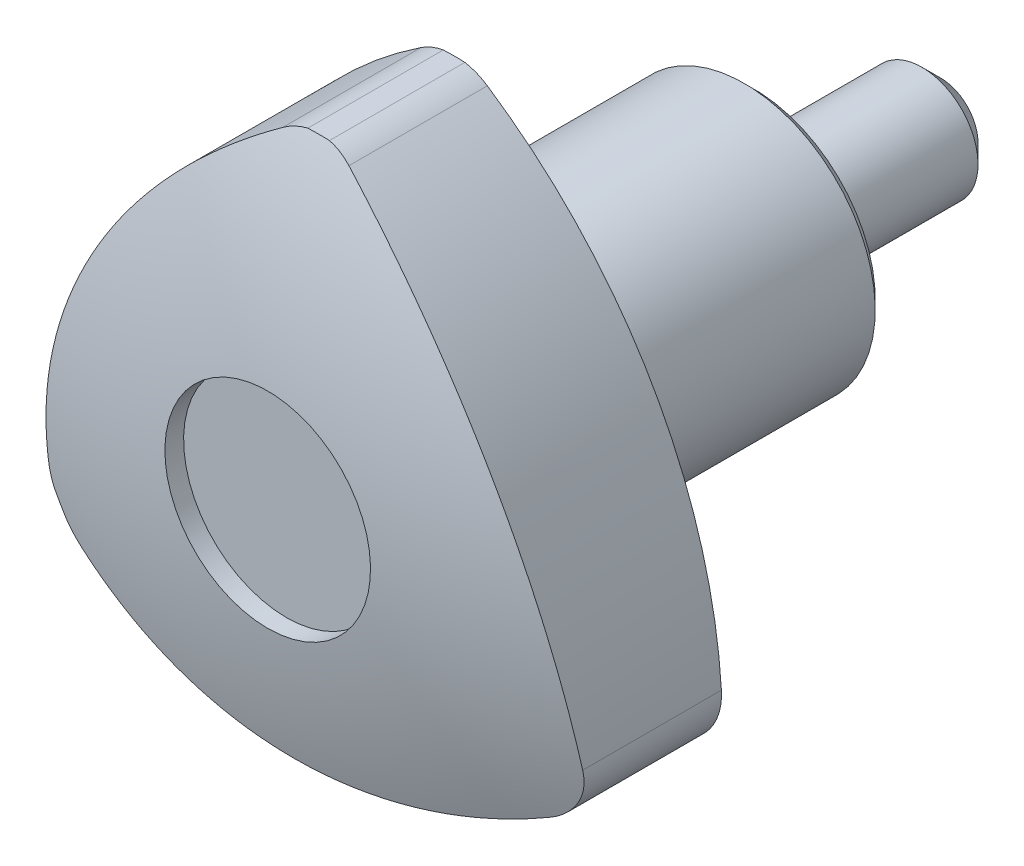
ISO-10303-21;
HEADER;
FILE_DESCRIPTION(('STEP AP214'),'2;1');
FILE_NAME('part.step','',(''),(''),'','','');
FILE_SCHEMA(('AUTOMOTIVE_DESIGN { 1 0 10303 214 1 1 1 1 }'));
ENDSEC;
DATA;
#1=APPLICATION_CONTEXT('core data for automotive mechanical design processes');
#2=APPLICATION_PROTOCOL_DEFINITION('international standard','automotive_design',2000,#1);
#3=PRODUCT_CONTEXT('',#1,'mechanical');
#4=PRODUCT('Part','Part','',(#3));
#5=PRODUCT_RELATED_PRODUCT_CATEGORY('part','',(#4));
#6=PRODUCT_DEFINITION_FORMATION('','',#4);
#7=PRODUCT_DEFINITION_CONTEXT('part definition',#1,'design');
#8=PRODUCT_DEFINITION('design','',#6,#7);
#9=PRODUCT_DEFINITION_SHAPE('','',#8);
#10=(LENGTH_UNIT() NAMED_UNIT(*) SI_UNIT(.MILLI.,.METRE.));
#11=(NAMED_UNIT(*) PLANE_ANGLE_UNIT() SI_UNIT($,.RADIAN.));
#12=(NAMED_UNIT(*) SI_UNIT($,.STERADIAN.) SOLID_ANGLE_UNIT());
#13=UNCERTAINTY_MEASURE_WITH_UNIT(LENGTH_MEASURE(1.E-05),#10,'distance_accuracy_value','');
#14=(GEOMETRIC_REPRESENTATION_CONTEXT(3) GLOBAL_UNCERTAINTY_ASSIGNED_CONTEXT((#13)) GLOBAL_UNIT_ASSIGNED_CONTEXT((#10,
#11,#12)) REPRESENTATION_CONTEXT('',''));
#15=CARTESIAN_POINT('',(0.,0.,0.));
#16=DIRECTION('',(0.,0.,1.));
#17=DIRECTION('',(1.,0.,0.));
#18=AXIS2_PLACEMENT_3D('',#15,#16,#17);
#19=CARTESIAN_POINT('',(0.,0.,28.5));
#20=DIRECTION('',(0.,0.,1.));
#21=DIRECTION('',(0.,-1.,0.));
#22=AXIS2_PLACEMENT_3D('',#19,#20,#21);
#23=CYLINDRICAL_SURFACE('',#22,16.0086520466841);
#24=DIRECTION('',(0.,0.,1.));
#25=VECTOR('',#24,1.);
#26=CARTESIAN_POINT('',(-13.4608410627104,-8.66502730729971,19.6229631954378));
#27=LINE('',#26,#25);
#28=CARTESIAN_POINT('',(-13.4608410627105,-8.66502730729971,23.2459263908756));
#29=VERTEX_POINT('',#28);
#30=CARTESIAN_POINT('',(-13.4608410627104,-8.66502730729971,16.));
#31=VERTEX_POINT('',#30);
#32=EDGE_CURVE('E135',#29,#31,#27,.F.);
#33=ORIENTED_EDGE('',*,*,#32,.F.);
#34=CARTESIAN_POINT('',(0.,0.,23.2459263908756));
#35=DIRECTION('',(0.,0.,1.));
#36=DIRECTION('',(0.,-1.,0.));
#37=AXIS2_PLACEMENT_3D('',#34,#35,#36);
#38=CIRCLE('',#37,16.0086520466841);
#39=CARTESIAN_POINT('',(-14.1801590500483,-7.42967224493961,23.2459263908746));
#40=VERTEX_POINT('',#39);
#41=EDGE_CURVE('E148',#40,#29,#38,.T.);
#42=ORIENTED_EDGE('',*,*,#41,.F.);
#43=DIRECTION('',(0.,0.,1.));
#44=VECTOR('',#43,1.);
#45=CARTESIAN_POINT('',(-14.1801590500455,-7.4296722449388,19.6229631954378));
#46=LINE('',#45,#44);
#47=CARTESIAN_POINT('',(-14.1801590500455,-7.4296722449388,16.));
#48=VERTEX_POINT('',#47);
#49=EDGE_CURVE('E139',#48,#40,#46,.T.);
#50=ORIENTED_EDGE('',*,*,#49,.F.);
#51=CARTESIAN_POINT('',(0.,0.,16.));
#52=DIRECTION('',(0.,0.,1.));
#53=DIRECTION('',(0.,-1.,0.));
#54=AXIS2_PLACEMENT_3D('',#51,#52,#53);
#55=CIRCLE('',#54,16.0086520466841);
#56=EDGE_CURVE('E152',#48,#31,#55,.T.);
#57=ORIENTED_EDGE('',*,*,#56,.T.);
#58=EDGE_LOOP('',(#33,#42,#50,#57));
#59=FACE_BOUND('',#58,.T.);
#60=ADVANCED_FACE('F14',(#59),#23,.T.);
#61=CARTESIAN_POINT('',(0.,2.,-10.));
#62=DIRECTION('',(0.,0.,-1.));
#63=DIRECTION('',(0.,1.,0.));
#64=AXIS2_PLACEMENT_3D('',#61,#62,#63);
#65=PLANE('',#64);
#66=CARTESIAN_POINT('',(0.,0.,-10.));
#67=DIRECTION('',(0.,0.,1.));
#68=DIRECTION('',(0.,-1.,0.));
#69=AXIS2_PLACEMENT_3D('',#66,#67,#68);
#70=CIRCLE('',#69,2.);
#71=CARTESIAN_POINT('',(0.,-2.,-10.));
#72=VERTEX_POINT('',#71);
#73=EDGE_CURVE('E171',#72,#72,#70,.T.);
#74=ORIENTED_EDGE('',*,*,#73,.F.);
#75=EDGE_LOOP('',(#74));
#76=FACE_BOUND('',#75,.T.);
#77=ADVANCED_FACE('F16',(#76),#65,.T.);
#78=CARTESIAN_POINT('',(0.,0.,-9.));
#79=DIRECTION('',(0.,0.,1.));
#80=DIRECTION('',(0.,-1.,0.));
#81=AXIS2_PLACEMENT_3D('',#78,#79,#80);
#82=CONICAL_SURFACE('',#81,3.,0.785398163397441);
#83=ORIENTED_EDGE('',*,*,#73,.T.);
#84=EDGE_LOOP('',(#83));
#85=FACE_BOUND('',#84,.T.);
#86=CARTESIAN_POINT('',(0.,0.,-9.));
#87=DIRECTION('',(0.,0.,1.));
#88=DIRECTION('',(0.,-1.,0.));
#89=AXIS2_PLACEMENT_3D('',#86,#87,#88);
#90=CIRCLE('',#89,3.);
#91=CARTESIAN_POINT('',(0.,-3.,-9.));
#92=VERTEX_POINT('',#91);
#93=EDGE_CURVE('E168',#92,#92,#90,.T.);
#94=ORIENTED_EDGE('',*,*,#93,.F.);
#95=EDGE_LOOP('',(#94));
#96=FACE_BOUND('',#95,.T.);
#97=ADVANCED_FACE('F278',(#85,#96),#82,.T.);
#98=CARTESIAN_POINT('',(0.,0.,28.5));
#99=DIRECTION('',(0.,0.,1.));
#100=DIRECTION('',(0.,-1.,0.));
#101=AXIS2_PLACEMENT_3D('',#98,#99,#100);
#102=CYLINDRICAL_SURFACE('',#101,3.);
#103=ORIENTED_EDGE('',*,*,#93,.T.);
#104=EDGE_LOOP('',(#103));
#105=FACE_BOUND('',#104,.T.);
#106=CARTESIAN_POINT('',(0.,0.,0.));
#107=DIRECTION('',(0.,0.,1.));
#108=DIRECTION('',(0.,-1.,0.));
#109=AXIS2_PLACEMENT_3D('',#106,#107,#108);
#110=CIRCLE('',#109,3.);
#111=CARTESIAN_POINT('',(0.,-3.,0.));
#112=VERTEX_POINT('',#111);
#113=EDGE_CURVE('E165',#112,#112,#110,.T.);
#114=ORIENTED_EDGE('',*,*,#113,.F.);
#115=EDGE_LOOP('',(#114));
#116=FACE_BOUND('',#115,.T.);
#117=ADVANCED_FACE('F377',(#105,#116),#102,.T.);
#118=CARTESIAN_POINT('',(0.,6.5,0.));
#119=DIRECTION('',(0.,0.,-1.));
#120=DIRECTION('',(0.,1.,0.));
#121=AXIS2_PLACEMENT_3D('',#118,#119,#120);
#122=PLANE('',#121);
#123=ORIENTED_EDGE('',*,*,#113,.T.);
#124=EDGE_LOOP('',(#123));
#125=FACE_BOUND('',#124,.T.);
#126=CARTESIAN_POINT('',(0.,0.,0.));
#127=DIRECTION('',(0.,0.,1.));
#128=DIRECTION('',(0.,-1.,0.));
#129=AXIS2_PLACEMENT_3D('',#126,#127,#128);
#130=CIRCLE('',#129,6.5);
#131=CARTESIAN_POINT('',(0.,-6.5,0.));
#132=VERTEX_POINT('',#131);
#133=EDGE_CURVE('E162',#132,#132,#130,.T.);
#134=ORIENTED_EDGE('',*,*,#133,.F.);
#135=EDGE_LOOP('',(#134));
#136=FACE_BOUND('',#135,.T.);
#137=ADVANCED_FACE('F367',(#125,#136),#122,.T.);
#138=CARTESIAN_POINT('',(0.,0.,0.));
#139=DIRECTION('',(0.,0.,1.));
#140=DIRECTION('',(0.,-1.,0.));
#141=AXIS2_PLACEMENT_3D('',#138,#139,#140);
#142=CONICAL_SURFACE('',#141,6.5,0.785398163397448);
#143=CARTESIAN_POINT('',(0.,0.,0.5));
#144=DIRECTION('',(0.,0.,1.));
#145=DIRECTION('',(0.,-1.,0.));
#146=AXIS2_PLACEMENT_3D('',#143,#144,#145);
#147=CIRCLE('',#146,7.);
#148=CARTESIAN_POINT('',(0.,-7.,0.500000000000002));
#149=VERTEX_POINT('',#148);
#150=EDGE_CURVE('E159',#149,#149,#147,.T.);
#151=ORIENTED_EDGE('',*,*,#150,.F.);
#152=EDGE_LOOP('',(#151));
#153=FACE_BOUND('',#152,.T.);
#154=ORIENTED_EDGE('',*,*,#133,.T.);
#155=EDGE_LOOP('',(#154));
#156=FACE_BOUND('',#155,.T.);
#157=ADVANCED_FACE('F357',(#153,#156),#142,.T.);
#158=CARTESIAN_POINT('',(0.,0.,28.5));
#159=DIRECTION('',(0.,0.,1.));
#160=DIRECTION('',(0.,-1.,0.));
#161=AXIS2_PLACEMENT_3D('',#158,#159,#160);
#162=CYLINDRICAL_SURFACE('',#161,7.);
#163=ORIENTED_EDGE('',*,*,#150,.T.);
#164=EDGE_LOOP('',(#163));
#165=FACE_BOUND('',#164,.T.);
#166=CARTESIAN_POINT('',(0.,0.,16.));
#167=DIRECTION('',(0.,0.,1.));
#168=DIRECTION('',(0.,-1.,0.));
#169=AXIS2_PLACEMENT_3D('',#166,#167,#168);
#170=CIRCLE('',#169,7.);
#171=CARTESIAN_POINT('',(0.,-7.,16.));
#172=VERTEX_POINT('',#171);
#173=EDGE_CURVE('E156',#172,#172,#170,.T.);
#174=ORIENTED_EDGE('',*,*,#173,.F.);
#175=EDGE_LOOP('',(#174));
#176=FACE_BOUND('',#175,.T.);
#177=ADVANCED_FACE('F286',(#165,#176),#162,.T.);
#178=CARTESIAN_POINT('',(0.,16.008652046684,16.));
#179=DIRECTION('',(0.,0.,-1.));
#180=DIRECTION('',(0.,1.,0.));
#181=AXIS2_PLACEMENT_3D('',#178,#179,#180);
#182=PLANE('',#181);
#183=CARTESIAN_POINT('',(-11.1250016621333,-6.4778249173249,16.));
#184=DIRECTION('',(0.,0.,-1.));
#185=DIRECTION('',(0.,1.,0.));
#186=AXIS2_PLACEMENT_3D('',#183,#184,#185);
#187=CIRCLE('',#186,3.2);
#188=CARTESIAN_POINT('',(-14.3089755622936,-6.15796525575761,16.));
#189=VERTEX_POINT('',#188);
#190=EDGE_CURVE('E140',#189,#48,#187,.F.);
#191=ORIENTED_EDGE('',*,*,#190,.F.);
#192=CARTESIAN_POINT('',(13.8335240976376,-7.9578855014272,16.));
#193=DIRECTION('',(0.,0.,-1.));
#194=DIRECTION('',(0.,1.,0.));
#195=AXIS2_PLACEMENT_3D('',#192,#193,#194);
#196=CIRCLE('',#195,28.2);
#197=CARTESIAN_POINT('',(-1.79650238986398,15.5142740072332,16.));
#198=VERTEX_POINT('',#197);
#199=EDGE_CURVE('E133',#198,#189,#196,.F.);
#200=ORIENTED_EDGE('',*,*,#199,.F.);
#201=CARTESIAN_POINT('',(-0.022882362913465,12.8507665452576,16.));
#202=DIRECTION('',(0.,0.,-1.));
#203=DIRECTION('',(0.,1.,0.));
#204=AXIS2_PLACEMENT_3D('',#201,#202,#203);
#205=CIRCLE('',#204,3.2);
#206=CARTESIAN_POINT('',(-0.606074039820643,15.9971752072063,16.));
#207=VERTEX_POINT('',#206);
#208=EDGE_CURVE('E124',#207,#198,#205,.F.);
#209=ORIENTED_EDGE('',*,*,#208,.F.);
#210=CARTESIAN_POINT('',(0.549100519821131,15.9992321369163,16.));
#211=VERTEX_POINT('',#210);
#212=EDGE_CURVE('E155',#211,#207,#55,.T.);
#213=ORIENTED_EDGE('',*,*,#212,.F.);
#214=CARTESIAN_POINT('',(1.75073766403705,15.5142740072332,16.));
#215=VERTEX_POINT('',#214);
#216=EDGE_CURVE('E121',#215,#211,#205,.F.);
#217=ORIENTED_EDGE('',*,*,#216,.F.);
#218=CARTESIAN_POINT('',(-13.8853713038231,-7.96701977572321,16.));
#219=DIRECTION('',(0.,0.,-1.));
#220=DIRECTION('',(0.,1.,0.));
#221=AXIS2_PLACEMENT_3D('',#218,#219,#220);
#222=CIRCLE('',#221,28.2109741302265);
#223=CARTESIAN_POINT('',(14.2717573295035,-6.2248462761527,16.));
#224=VERTEX_POINT('',#223);
#225=EDGE_CURVE('E112',#224,#215,#222,.F.);
#226=ORIENTED_EDGE('',*,*,#225,.F.);
#227=CARTESIAN_POINT('',(11.0782821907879,-6.4290925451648,16.));
#228=DIRECTION('',(0.,0.,-1.));
#229=DIRECTION('',(0.,1.,0.));
#230=AXIS2_PLACEMENT_3D('',#227,#228,#229);
#231=CIRCLE('',#230,3.2);
#232=CARTESIAN_POINT('',(12.4981373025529,-9.29684627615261,16.));
#233=VERTEX_POINT('',#232);
#234=EDGE_CURVE('E98',#233,#224,#231,.F.);
#235=ORIENTED_EDGE('',*,*,#234,.F.);
#236=CARTESIAN_POINT('',(-0.0716447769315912,16.0084917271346,16.));
#237=DIRECTION('',(0.,0.,-1.));
#238=DIRECTION('',(0.,1.,0.));
#239=AXIS2_PLACEMENT_3D('',#236,#237,#238);
#240=CIRCLE('',#239,28.25525708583);
#241=CARTESIAN_POINT('',(-12.6086357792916,-9.31310793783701,16.));
#242=VERTEX_POINT('',#241);
#243=EDGE_CURVE('E109',#242,#233,#240,.F.);
#244=ORIENTED_EDGE('',*,*,#243,.F.);
#245=EDGE_CURVE('E137',#31,#242,#187,.F.);
#246=ORIENTED_EDGE('',*,*,#245,.F.);
#247=ORIENTED_EDGE('',*,*,#56,.F.);
#248=EDGE_LOOP('',(#191,#200,#209,#213,#217,#226,#235,#244,#246,#247));
#249=FACE_BOUND('',#248,.T.);
#250=ORIENTED_EDGE('',*,*,#173,.T.);
#251=EDGE_LOOP('',(#250));
#252=FACE_BOUND('',#251,.T.);
#253=ADVANCED_FACE('F118',(#249,#252),#182,.T.);
#254=DIRECTION('',(0.,0.,1.));
#255=VECTOR('',#254,1.);
#256=CARTESIAN_POINT('',(-0.606074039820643,15.9971752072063,19.6229631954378));
#257=LINE('',#256,#255);
#258=CARTESIAN_POINT('',(-0.606074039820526,15.9971752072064,23.2459263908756));
#259=VERTEX_POINT('',#258);
#260=EDGE_CURVE('E122',#259,#207,#257,.F.);
#261=ORIENTED_EDGE('',*,*,#260,.F.);
#262=CARTESIAN_POINT('',(0.549100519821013,15.9992321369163,23.2459263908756));
#263=VERTEX_POINT('',#262);
#264=EDGE_CURVE('E151',#263,#259,#38,.T.);
#265=ORIENTED_EDGE('',*,*,#264,.F.);
#266=DIRECTION('',(0.,0.,1.));
#267=VECTOR('',#266,1.);
#268=CARTESIAN_POINT('',(0.549100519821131,15.9992321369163,19.6229631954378));
#269=LINE('',#268,#267);
#270=EDGE_CURVE('E131',#211,#263,#269,.T.);
#271=ORIENTED_EDGE('',*,*,#270,.F.);
#272=ORIENTED_EDGE('',*,*,#212,.T.);
#273=EDGE_LOOP('',(#261,#265,#271,#272));
#274=FACE_BOUND('',#273,.T.);
#275=ADVANCED_FACE('F270',(#274),#23,.T.);
#276=CARTESIAN_POINT('',(0.,0.,-15.6637585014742));
#277=DIRECTION('',(0.,0.,1.));
#278=DIRECTION('',(0.,-1.,0.));
#279=AXIS2_PLACEMENT_3D('',#276,#277,#278);
#280=DEGENERATE_TOROIDAL_SURFACE('',#279,0.196112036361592,42.,.T.);
#281=CARTESIAN_POINT('',(-1.79630238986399,15.5144071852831,23.4023877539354));
#282=CARTESIAN_POINT('',(-2.07698854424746,15.3275033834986,23.4629368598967));
#283=CARTESIAN_POINT('',(-2.3546332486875,15.135355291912,23.5212165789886));
#284=CARTESIAN_POINT('',(-2.90344894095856,14.7407484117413,23.6331981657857));
#285=CARTESIAN_POINT('',(-3.17461983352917,14.5382894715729,23.686899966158));
#286=CARTESIAN_POINT('',(-3.97772870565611,13.9157950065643,23.841059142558));
#287=CARTESIAN_POINT('',(-4.4993623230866,13.4805756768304,23.9345917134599));
#288=CARTESIAN_POINT('',(-5.51106968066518,12.5723021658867,24.1027375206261));
#289=CARTESIAN_POINT('',(-6.00116556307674,12.0992750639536,24.1773641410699));
#290=CARTESIAN_POINT('',(-6.94703112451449,11.1175731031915,24.3075341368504));
#291=CARTESIAN_POINT('',(-7.40279978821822,10.6088971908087,24.3630769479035));
#292=CARTESIAN_POINT('',(-8.32010026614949,9.50694168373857,24.4594041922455));
#293=CARTESIAN_POINT('',(-8.77777070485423,8.91026524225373,24.4981938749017));
#294=CARTESIAN_POINT('',(-9.64445084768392,7.68148925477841,24.5523332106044));
#295=CARTESIAN_POINT('',(-10.0534561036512,7.04938647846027,24.5676807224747));
#296=CARTESIAN_POINT('',(-10.8197090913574,5.75430776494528,24.5748681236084));
#297=CARTESIAN_POINT('',(-11.1769500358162,5.0913277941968,24.5667049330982));
#298=CARTESIAN_POINT('',(-11.8370049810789,3.73953558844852,24.5268983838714));
#299=CARTESIAN_POINT('',(-12.1398222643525,3.05072491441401,24.4952564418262));
#300=CARTESIAN_POINT('',(-12.6825037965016,1.66905373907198,24.4096575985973));
#301=CARTESIAN_POINT('',(-12.9236949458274,0.976679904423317,24.3562497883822));
#302=CARTESIAN_POINT('',(-13.3510067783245,-0.422854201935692,24.2274039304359));
#303=CARTESIAN_POINT('',(-13.5371252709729,-1.13001506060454,24.1519650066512));
#304=CARTESIAN_POINT('',(-13.8537043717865,-2.55505325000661,23.9792440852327));
#305=CARTESIAN_POINT('',(-13.9840970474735,-3.27294256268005,23.8819356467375));
#306=CARTESIAN_POINT('',(-14.1375025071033,-4.35315275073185,23.7199750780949));
#307=CARTESIAN_POINT('',(-14.1816087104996,-4.71381138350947,23.6633172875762));
#308=CARTESIAN_POINT('',(-14.2558009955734,-5.43569535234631,23.5447201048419));
#309=CARTESIAN_POINT('',(-14.285887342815,-5.79692067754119,23.4827808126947));
#310=CARTESIAN_POINT('',(-14.3089883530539,-6.1581652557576,23.4182246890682));
#311=B_SPLINE_CURVE_WITH_KNOTS('',3,(#281,#282,#283,#284,#285,#286,#287,#288,#289,#290,#291,
#292,#293,#294,#295,#296,#297,#298,#299,#300,#301,#302,#303,#304,#305,#306,#307,#308,#309,#310),
.UNSPECIFIED.,.F.,.F.,(4,2,2,2,2,2,2,2,2,2,2,2,2,2,4),(0.,1.02771394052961,2.05544299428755,
4.11053801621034,6.16417407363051,8.21787084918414,10.4740293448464,12.730393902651,
14.9870540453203,17.2435780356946,19.4463899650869,21.6492894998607,23.854866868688,
24.9578130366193,26.0607383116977),.UNSPECIFIED.);
#312=CARTESIAN_POINT('',(-1.79650238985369,15.5142740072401,23.4024308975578));
#313=VERTEX_POINT('',#312);
#314=CARTESIAN_POINT('',(-14.3089755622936,-6.15796525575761,23.418260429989));
#315=VERTEX_POINT('',#314);
#316=EDGE_CURVE('E28',#313,#315,#311,.T.);
#317=ORIENTED_EDGE('',*,*,#316,.T.);
#318=CARTESIAN_POINT('',(-14.3089554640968,-6.15776525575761,23.418298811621));
#319=CARTESIAN_POINT('',(-14.3176851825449,-6.24450181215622,23.4016495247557));
#320=CARTESIAN_POINT('',(-14.3228677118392,-6.33177602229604,23.3858978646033));
#321=CARTESIAN_POINT('',(-14.3260655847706,-6.50684738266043,23.3563078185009));
#322=CARTESIAN_POINT('',(-14.3240753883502,-6.59464488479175,23.3424709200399));
#323=CARTESIAN_POINT('',(-14.3129388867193,-6.76855033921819,23.3170771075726));
#324=CARTESIAN_POINT('',(-14.3039175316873,-6.85466113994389,23.3054847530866));
#325=CARTESIAN_POINT('',(-14.2788759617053,-7.02606635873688,23.2843988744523));
#326=CARTESIAN_POINT('',(-14.2628609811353,-7.11136133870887,23.274903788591));
#327=CARTESIAN_POINT('',(-14.2342505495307,-7.23560432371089,23.2625598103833));
#328=CARTESIAN_POINT('',(-14.2243564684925,-7.27510769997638,23.2588594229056));
#329=CARTESIAN_POINT('',(-14.2030119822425,-7.35391003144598,23.2519306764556));
#330=CARTESIAN_POINT('',(-14.1915553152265,-7.39320746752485,23.2487043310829));
#331=CARTESIAN_POINT('',(-14.1793414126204,-7.43229266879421,23.2457263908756));
#332=B_SPLINE_CURVE_WITH_KNOTS('',3,(#318,#319,#320,#321,#322,#323,#324,#325,#326,#327,#328,
#329,#330,#331),.UNSPECIFIED.,.F.,.F.,(4,2,2,2,2,2,4),(0.,0.266188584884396,0.532582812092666,
0.7943479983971,1.0559176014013,1.17856410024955,1.30171737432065),.UNSPECIFIED.);
#333=EDGE_CURVE('E9',#315,#40,#332,.T.);
#334=ORIENTED_EDGE('',*,*,#333,.T.);
#335=ORIENTED_EDGE('',*,*,#41,.T.);
#336=CARTESIAN_POINT('',(-13.4627164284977,-8.66302277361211,23.2457263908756));
#337=CARTESIAN_POINT('',(-13.4007688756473,-8.72931153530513,23.2523204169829));
#338=CARTESIAN_POINT('',(-13.3360514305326,-8.7928781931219,23.2601429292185));
#339=CARTESIAN_POINT('',(-13.2021554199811,-8.91369905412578,23.2780776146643));
#340=CARTESIAN_POINT('',(-13.1330142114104,-8.97099727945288,23.2881720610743));
#341=CARTESIAN_POINT('',(-12.9903993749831,-9.07942369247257,23.3105855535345));
#342=CARTESIAN_POINT('',(-12.9169259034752,-9.13055210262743,23.3229045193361));
#343=CARTESIAN_POINT('',(-12.7656645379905,-9.22670364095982,23.3497444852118));
#344=CARTESIAN_POINT('',(-12.6878480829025,-9.2716773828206,23.3642815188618));
#345=CARTESIAN_POINT('',(-12.6084357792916,-9.31321258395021,23.3798210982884));
#346=B_SPLINE_CURVE_WITH_KNOTS('',3,(#336,#337,#338,#339,#340,#341,#342,#343,#344,#345),
.UNSPECIFIED.,.F.,.F.,(4,2,2,2,4),(0.,0.272801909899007,0.543544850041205,0.814278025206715,
1.08707007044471),.UNSPECIFIED.);
#347=CARTESIAN_POINT('',(-12.6086357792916,-9.31310793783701,23.37978196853));
#348=VERTEX_POINT('',#347);
#349=EDGE_CURVE('E212',#29,#348,#346,.T.);
#350=ORIENTED_EDGE('',*,*,#349,.T.);
#351=CARTESIAN_POINT('',(-12.6088357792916,-9.3130089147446,23.3797415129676));
#352=CARTESIAN_POINT('',(-12.3055074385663,-9.46319356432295,23.4410984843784));
#353=CARTESIAN_POINT('',(-11.9991370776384,-9.60809559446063,23.5001670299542));
#354=CARTESIAN_POINT('',(-11.3806640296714,-9.88708206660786,23.6136876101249));
#355=CARTESIAN_POINT('',(-11.0685612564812,-10.0211663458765,23.6681395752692));
#356=CARTESIAN_POINT('',(-10.1243054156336,-10.4067626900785,23.8244902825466));
#357=CARTESIAN_POINT('',(-9.48409889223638,-10.6416707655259,23.919405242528));
#358=CARTESIAN_POINT('',(-8.18658906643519,-11.0649766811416,24.0901497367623));
#359=CARTESIAN_POINT('',(-7.52929843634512,-11.2534079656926,24.1659929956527));
#360=CARTESIAN_POINT('',(-6.20091939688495,-11.5824443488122,24.2984277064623));
#361=CARTESIAN_POINT('',(-5.52983060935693,-11.7230481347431,24.3550186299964));
#362=CARTESIAN_POINT('',(-4.11271204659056,-11.9664020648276,24.4532578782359));
#363=CARTESIAN_POINT('',(-3.36568987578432,-12.0642018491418,24.4929419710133));
#364=CARTESIAN_POINT('',(-1.86529245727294,-12.1998380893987,24.5487548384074));
#365=CARTESIAN_POINT('',(-1.11191664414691,-12.237669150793,24.5648814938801));
#366=CARTESIAN_POINT('',(0.395681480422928,-12.252957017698,24.5735088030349));
#367=CARTESIAN_POINT('',(1.14990388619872,-12.2304062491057,24.5660064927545));
#368=CARTESIAN_POINT('',(2.65348436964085,-12.1251385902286,24.5274007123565));
#369=CARTESIAN_POINT('',(3.40284273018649,-12.0424252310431,24.4962986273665));
#370=CARTESIAN_POINT('',(4.87529751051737,-11.8200865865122,24.4115420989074));
#371=CARTESIAN_POINT('',(5.59861267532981,-11.681717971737,24.3583848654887));
#372=CARTESIAN_POINT('',(7.03037870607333,-11.3495233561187,24.2298123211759));
#373=CARTESIAN_POINT('',(7.73882894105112,-11.1556950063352,24.1543960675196));
#374=CARTESIAN_POINT('',(9.13703267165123,-10.7141168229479,23.9814895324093));
#375=CARTESIAN_POINT('',(9.82676149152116,-10.4662993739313,23.8839715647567));
#376=CARTESIAN_POINT('',(10.8430116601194,-10.0561095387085,23.7215268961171));
#377=CARTESIAN_POINT('',(11.178727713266,-9.91295745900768,23.6646794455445));
#378=CARTESIAN_POINT('',(11.8435779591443,-9.61415098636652,23.5456467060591));
#379=CARTESIAN_POINT('',(12.1727122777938,-9.45849683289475,23.4834615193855));
#380=CARTESIAN_POINT('',(12.4983373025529,-9.29674693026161,23.418631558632));
#381=B_SPLINE_CURVE_WITH_KNOTS('',3,(#351,#352,#353,#354,#355,#356,#357,#358,#359,#360,#361,
#362,#363,#364,#365,#366,#367,#368,#369,#370,#371,#372,#373,#374,#375,#376,#377,#378,#379,#380),
.UNSPECIFIED.,.F.,.F.,(4,2,2,2,2,2,2,2,2,2,2,2,2,2,4),(0.,1.0318387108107,2.06369294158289,
4.12704188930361,6.1889017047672,8.2508181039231,10.511333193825,12.7720516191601,
15.0330536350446,17.2939229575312,19.5063769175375,21.7189245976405,23.9342593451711,
25.0420839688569,26.1498873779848),.UNSPECIFIED.);
#382=CARTESIAN_POINT('',(12.4981373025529,-9.29684627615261,23.4186713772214));
#383=VERTEX_POINT('',#382);
#384=EDGE_CURVE('E245',#348,#383,#381,.T.);
#385=ORIENTED_EDGE('',*,*,#384,.T.);
#386=CARTESIAN_POINT('',(12.4979373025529,-9.2969452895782,23.4187112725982));
#387=CARTESIAN_POINT('',(12.5748628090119,-9.2588750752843,23.4033642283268));
#388=CARTESIAN_POINT('',(12.6503949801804,-9.21762182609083,23.3889145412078));
#389=CARTESIAN_POINT('',(12.7981486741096,-9.12899404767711,23.3619232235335));
#390=CARTESIAN_POINT('',(12.87036975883,-9.08161871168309,23.3493818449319));
#391=CARTESIAN_POINT('',(13.0109734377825,-8.9809897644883,23.3263218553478));
#392=CARTESIAN_POINT('',(13.0793551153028,-8.92773475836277,23.3158037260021));
#393=CARTESIAN_POINT('',(13.211721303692,-8.8157149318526,23.2968923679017));
#394=CARTESIAN_POINT('',(13.2757061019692,-8.75695047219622,23.2884990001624));
#395=CARTESIAN_POINT('',(13.4604831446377,-8.57275973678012,23.2666168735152));
#396=CARTESIAN_POINT('',(13.5740388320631,-8.43947843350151,23.2564358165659));
#397=CARTESIAN_POINT('',(13.7779167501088,-8.15607340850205,23.2453544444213));
#398=CARTESIAN_POINT('',(13.868253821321,-8.00596053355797,23.2444481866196));
#399=CARTESIAN_POINT('',(14.0218734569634,-7.69586047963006,23.2518557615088));
#400=CARTESIAN_POINT('',(14.0855879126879,-7.53608334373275,23.2600138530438));
#401=CARTESIAN_POINT('',(14.1865077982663,-7.20897125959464,23.2850007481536));
#402=CARTESIAN_POINT('',(14.2237130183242,-7.04163625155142,23.3018296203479));
#403=CARTESIAN_POINT('',(14.262455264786,-6.76515032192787,23.3359860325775));
#404=CARTESIAN_POINT('',(14.2720131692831,-6.65675467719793,23.3509500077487));
#405=CARTESIAN_POINT('',(14.2800932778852,-6.44026443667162,23.3838994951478));
#406=CARTESIAN_POINT('',(14.2786408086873,-6.33216972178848,23.4018779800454));
#407=CARTESIAN_POINT('',(14.2717445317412,-6.22464627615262,23.4212719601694));
#408=B_SPLINE_CURVE_WITH_KNOTS('',3,(#386,#387,#388,#389,#390,#391,#392,#393,#394,#395,#396,
#397,#398,#399,#400,#401,#402,#403,#404,#405,#406,#407),.UNSPECIFIED.,.F.,.F.,(4,2,2,2,2,2,2,2,
2,2,4),(0.,0.261504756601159,0.523044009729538,0.784645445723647,1.04622976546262,
1.56961587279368,2.09266661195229,2.60686752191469,3.12107250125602,3.45004052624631,
3.77825207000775),.UNSPECIFIED.);
#409=CARTESIAN_POINT('',(14.2717573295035,-6.2248462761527,23.4212358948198));
#410=VERTEX_POINT('',#409);
#411=EDGE_CURVE('E246',#383,#410,#408,.T.);
#412=ORIENTED_EDGE('',*,*,#411,.T.);
#413=CARTESIAN_POINT('',(14.2717697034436,-6.22504627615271,23.4211999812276));
#414=CARTESIAN_POINT('',(14.2510167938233,-5.88958895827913,23.4814375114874));
#415=CARTESIAN_POINT('',(14.2242440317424,-5.55413019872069,23.5394141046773));
#416=CARTESIAN_POINT('',(14.1586169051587,-4.88363293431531,23.6508067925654));
#417=CARTESIAN_POINT('',(14.1197623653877,-4.54859443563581,23.70422282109));
#418=CARTESIAN_POINT('',(13.9850304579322,-3.54487832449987,23.8575513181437));
#419=CARTESIAN_POINT('',(13.8709774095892,-2.87747982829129,23.9505657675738));
#420=CARTESIAN_POINT('',(13.594649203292,-1.55091932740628,24.1177509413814));
#421=CARTESIAN_POINT('',(13.4324089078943,-0.891751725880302,24.191935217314));
#422=CARTESIAN_POINT('',(13.060201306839,0.414904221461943,24.3213006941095));
#423=CARTESIAN_POINT('',(12.8502324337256,1.06239218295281,24.3764812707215));
#424=CARTESIAN_POINT('',(12.3596239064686,2.40710418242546,24.4723006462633));
#425=CARTESIAN_POINT('',(12.0739544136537,3.10264721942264,24.5108765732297));
#426=CARTESIAN_POINT('',(11.4475635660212,4.46948793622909,24.56453592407));
#427=CARTESIAN_POINT('',(11.1068371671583,5.14078338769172,24.5796171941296));
#428=CARTESIAN_POINT('',(10.3726951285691,6.45419207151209,24.5862209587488));
#429=CARTESIAN_POINT('',(9.97927065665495,7.09630038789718,24.5777394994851));
#430=CARTESIAN_POINT('',(9.1427582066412,8.34647043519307,24.537244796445));
#431=CARTESIAN_POINT('',(8.69967292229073,8.95453401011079,24.5052328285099));
#432=CARTESIAN_POINT('',(7.77326280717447,10.1247562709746,24.4183726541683));
#433=CARTESIAN_POINT('',(7.29052764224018,10.6874040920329,24.3638229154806));
#434=CARTESIAN_POINT('',(6.283743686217,11.7716034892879,24.2321495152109));
#435=CARTESIAN_POINT('',(5.75969272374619,12.2931529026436,24.1550246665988));
#436=CARTESIAN_POINT('',(4.67358587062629,13.2925499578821,23.9783914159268));
#437=CARTESIAN_POINT('',(4.11148134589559,13.7703397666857,23.8788539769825));
#438=CARTESIAN_POINT('',(3.24378976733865,14.4514160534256,23.7131646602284));
#439=CARTESIAN_POINT('',(2.9504496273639,14.6725203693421,23.6551999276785));
#440=CARTESIAN_POINT('',(2.35611193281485,15.1026097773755,23.5338627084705));
#441=CARTESIAN_POINT('',(2.05511453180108,15.3115951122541,23.4704903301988));
#442=CARTESIAN_POINT('',(1.75053766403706,15.5144071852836,23.4044391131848));
#443=B_SPLINE_CURVE_WITH_KNOTS('',3,(#413,#414,#415,#416,#417,#418,#419,#420,#421,#422,#423,
#424,#425,#426,#427,#428,#429,#430,#431,#432,#433,#434,#435,#436,#437,#438,#439,#440,#441,#442),
.UNSPECIFIED.,.F.,.F.,(4,2,2,2,2,2,2,2,2,2,2,2,2,2,4),(0.,1.02423707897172,2.04848901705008,
4.09662661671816,6.14328602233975,8.19001265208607,10.4459424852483,12.7020791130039,
14.9585943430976,17.2149872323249,19.4424106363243,21.6699511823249,23.9003944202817,
25.0157655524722,26.1311143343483),.UNSPECIFIED.);
#444=CARTESIAN_POINT('',(1.75073766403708,15.5142740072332,23.4044824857));
#445=VERTEX_POINT('',#444);
#446=EDGE_CURVE('E114',#410,#445,#443,.T.);
#447=ORIENTED_EDGE('',*,*,#446,.T.);
#448=CARTESIAN_POINT('',(1.75093766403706,15.5141408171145,23.404525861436));
#449=CARTESIAN_POINT('',(1.67856381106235,15.5623551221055,23.3888239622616));
#450=CARTESIAN_POINT('',(1.60406788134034,15.6076980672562,23.3740433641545));
#451=CARTESIAN_POINT('',(1.45128992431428,15.6923204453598,23.3464359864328));
#452=CARTESIAN_POINT('',(1.37300514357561,15.7315953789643,23.3336106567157));
#453=CARTESIAN_POINT('',(1.21462657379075,15.8030522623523,23.3102565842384));
#454=CARTESIAN_POINT('',(1.1345891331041,15.8353472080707,23.2996912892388));
#455=CARTESIAN_POINT('',(0.971989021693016,15.8934091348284,23.2806787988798));
#456=CARTESIAN_POINT('',(0.889428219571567,15.9191808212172,23.2722300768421));
#457=CARTESIAN_POINT('',(0.763098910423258,15.9530557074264,23.2611116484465));
#458=CARTESIAN_POINT('',(0.720052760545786,15.9636452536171,23.2576333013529));
#459=CARTESIAN_POINT('',(0.63331811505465,15.9830795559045,23.2512444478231));
#460=CARTESIAN_POINT('',(0.589627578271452,15.9919160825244,23.2483366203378));
#461=CARTESIAN_POINT('',(0.545748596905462,15.9998392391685,23.2457263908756));
#462=B_SPLINE_CURVE_WITH_KNOTS('',3,(#448,#449,#450,#451,#452,#453,#454,#455,#456,#457,#458,
#459,#460,#461),.UNSPECIFIED.,.F.,.F.,(4,2,2,2,2,2,4),(0.,0.265044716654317,0.530285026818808,
0.790841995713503,1.05121048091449,1.18457127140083,1.31854402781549),.UNSPECIFIED.);
#463=EDGE_CURVE('E180',#445,#263,#462,.T.);
#464=ORIENTED_EDGE('',*,*,#463,.T.);
#465=ORIENTED_EDGE('',*,*,#264,.T.);
#466=CARTESIAN_POINT('',(-0.602724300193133,15.9977942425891,23.2457263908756));
#467=CARTESIAN_POINT('',(-0.689474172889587,15.9818229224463,23.2508860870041));
#468=CARTESIAN_POINT('',(-0.77548690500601,15.9622547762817,23.2572188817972));
#469=CARTESIAN_POINT('',(-0.945458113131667,15.9161521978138,23.2721523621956));
#470=CARTESIAN_POINT('',(-1.02941583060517,15.889615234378,23.2807538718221));
#471=CARTESIAN_POINT('',(-1.19321707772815,15.8303268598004,23.2999764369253));
#472=CARTESIAN_POINT('',(-1.27310646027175,15.7976897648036,23.3105603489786));
#473=CARTESIAN_POINT('',(-1.42971220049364,15.7262195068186,23.3337359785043));
#474=CARTESIAN_POINT('',(-1.50643045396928,15.6873901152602,23.3463264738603));
#475=CARTESIAN_POINT('',(-1.61805175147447,15.6251503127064,23.3665022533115));
#476=CARTESIAN_POINT('',(-1.65434376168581,15.6039640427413,23.3733691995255));
#477=CARTESIAN_POINT('',(-1.72615681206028,15.5601267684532,23.3875754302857));
#478=CARTESIAN_POINT('',(-1.76167388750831,15.5374698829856,23.3949166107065));
#479=CARTESIAN_POINT('',(-1.79670238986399,15.5141408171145,23.4024740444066));
#480=B_SPLINE_CURVE_WITH_KNOTS('',3,(#466,#467,#468,#469,#470,#471,#472,#473,#474,#475,#476,
#477,#478,#479),.UNSPECIFIED.,.F.,.F.,(4,2,2,2,2,2,4),(0.,0.264986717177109,0.530069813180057,
0.790609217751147,1.05099054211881,1.1787034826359,1.30696305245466),.UNSPECIFIED.);
#481=EDGE_CURVE('E205',#259,#313,#480,.T.);
#482=ORIENTED_EDGE('',*,*,#481,.T.);
#483=EDGE_LOOP('',(#317,#334,#335,#350,#385,#412,#447,#464,#465,#482));
#484=FACE_BOUND('',#483,.T.);
#485=CARTESIAN_POINT('',(0.,0.,26.));
#486=DIRECTION('',(0.,0.,1.));
#487=DIRECTION('',(0.,-1.,0.));
#488=AXIS2_PLACEMENT_3D('',#485,#486,#487);
#489=CIRCLE('',#488,5.50000000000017);
#490=CARTESIAN_POINT('',(0.,-5.50000000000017,26.));
#491=VERTEX_POINT('',#490);
#492=EDGE_CURVE('E145',#491,#491,#489,.T.);
#493=ORIENTED_EDGE('',*,*,#492,.F.);
#494=EDGE_LOOP('',(#493));
#495=FACE_BOUND('',#494,.T.);
#496=ADVANCED_FACE('F187',(#484,#495),#280,.T.);
#497=CARTESIAN_POINT('',(0.,0.,28.5));
#498=DIRECTION('',(0.,0.,1.));
#499=DIRECTION('',(0.,-1.,0.));
#500=AXIS2_PLACEMENT_3D('',#497,#498,#499);
#501=CYLINDRICAL_SURFACE('',#500,5.50000000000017);
#502=CARTESIAN_POINT('',(0.,0.,25.));
#503=DIRECTION('',(0.,0.,1.));
#504=DIRECTION('',(0.,-1.,0.));
#505=AXIS2_PLACEMENT_3D('',#502,#503,#504);
#506=CIRCLE('',#505,5.50000000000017);
#507=CARTESIAN_POINT('',(0.,-5.50000000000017,25.));
#508=VERTEX_POINT('',#507);
#509=EDGE_CURVE('E108',#508,#508,#506,.T.);
#510=ORIENTED_EDGE('',*,*,#509,.F.);
#511=EDGE_LOOP('',(#510));
#512=FACE_BOUND('',#511,.T.);
#513=ORIENTED_EDGE('',*,*,#492,.T.);
#514=EDGE_LOOP('',(#513));
#515=FACE_BOUND('',#514,.T.);
#516=ADVANCED_FACE('F262',(#512,#515),#501,.F.);
#517=CARTESIAN_POINT('',(0.,5.5,25.));
#518=DIRECTION('',(0.,0.,-1.));
#519=DIRECTION('',(0.,1.,0.));
#520=AXIS2_PLACEMENT_3D('',#517,#518,#519);
#521=PLANE('',#520);
#522=ORIENTED_EDGE('',*,*,#509,.T.);
#523=EDGE_LOOP('',(#522));
#524=FACE_BOUND('',#523,.T.);
#525=ADVANCED_FACE('F195',(#524),#521,.F.);
#526=CARTESIAN_POINT('',(-13.8853713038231,-7.96701977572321,-4.));
#527=DIRECTION('',(0.,0.,1.));
#528=DIRECTION('',(1.,0.,0.));
#529=AXIS2_PLACEMENT_3D('',#526,#527,#528);
#530=CYLINDRICAL_SURFACE('',#529,28.2109741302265);
#531=ORIENTED_EDGE('',*,*,#225,.T.);
#532=DIRECTION('',(0.,0.,1.));
#533=VECTOR('',#532,1.);
#534=CARTESIAN_POINT('',(1.75073766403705,15.5142740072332,-4.));
#535=LINE('',#534,#533);
#536=EDGE_CURVE('E43',#215,#445,#535,.T.);
#537=ORIENTED_EDGE('',*,*,#536,.T.);
#538=ORIENTED_EDGE('',*,*,#446,.F.);
#539=DIRECTION('',(0.,0.,1.));
#540=VECTOR('',#539,1.);
#541=CARTESIAN_POINT('',(14.2717573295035,-6.2248462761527,-4.));
#542=LINE('',#541,#540);
#543=EDGE_CURVE('E101',#224,#410,#542,.T.);
#544=ORIENTED_EDGE('',*,*,#543,.F.);
#545=EDGE_LOOP('',(#531,#537,#538,#544));
#546=FACE_BOUND('',#545,.T.);
#547=ADVANCED_FACE('F111',(#546),#530,.T.);
#548=CARTESIAN_POINT('',(-0.022882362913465,12.8507665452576,-4.));
#549=DIRECTION('',(0.,0.,1.));
#550=DIRECTION('',(1.,0.,0.));
#551=AXIS2_PLACEMENT_3D('',#548,#549,#550);
#552=CYLINDRICAL_SURFACE('',#551,3.2);
#553=ORIENTED_EDGE('',*,*,#216,.T.);
#554=ORIENTED_EDGE('',*,*,#270,.T.);
#555=ORIENTED_EDGE('',*,*,#463,.F.);
#556=ORIENTED_EDGE('',*,*,#536,.F.);
#557=EDGE_LOOP('',(#553,#554,#555,#556));
#558=FACE_BOUND('',#557,.T.);
#559=ADVANCED_FACE('F194',(#558),#552,.T.);
#560=CARTESIAN_POINT('',(-11.1250016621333,-6.4778249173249,-4.));
#561=DIRECTION('',(0.,0.,1.));
#562=DIRECTION('',(1.,0.,0.));
#563=AXIS2_PLACEMENT_3D('',#560,#561,#562);
#564=CYLINDRICAL_SURFACE('',#563,3.2);
#565=ORIENTED_EDGE('',*,*,#245,.T.);
#566=DIRECTION('',(0.,0.,1.));
#567=VECTOR('',#566,1.);
#568=CARTESIAN_POINT('',(-12.6086357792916,-9.31310793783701,-4.));
#569=LINE('',#568,#567);
#570=EDGE_CURVE('E126',#242,#348,#569,.T.);
#571=ORIENTED_EDGE('',*,*,#570,.T.);
#572=ORIENTED_EDGE('',*,*,#349,.F.);
#573=ORIENTED_EDGE('',*,*,#32,.T.);
#574=EDGE_LOOP('',(#565,#571,#572,#573));
#575=FACE_BOUND('',#574,.T.);
#576=ADVANCED_FACE('F240',(#575),#564,.T.);
#577=CARTESIAN_POINT('',(-0.0716447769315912,16.0084917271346,-4.));
#578=DIRECTION('',(0.,0.,1.));
#579=DIRECTION('',(1.,0.,0.));
#580=AXIS2_PLACEMENT_3D('',#577,#578,#579);
#581=CYLINDRICAL_SURFACE('',#580,28.25525708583);
#582=ORIENTED_EDGE('',*,*,#243,.T.);
#583=DIRECTION('',(0.,0.,1.));
#584=VECTOR('',#583,1.);
#585=CARTESIAN_POINT('',(12.4981373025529,-9.29684627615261,-4.));
#586=LINE('',#585,#584);
#587=EDGE_CURVE('E104',#233,#383,#586,.T.);
#588=ORIENTED_EDGE('',*,*,#587,.T.);
#589=ORIENTED_EDGE('',*,*,#384,.F.);
#590=ORIENTED_EDGE('',*,*,#570,.F.);
#591=EDGE_LOOP('',(#582,#588,#589,#590));
#592=FACE_BOUND('',#591,.T.);
#593=ADVANCED_FACE('F256',(#592),#581,.T.);
#594=CARTESIAN_POINT('',(11.0782821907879,-6.4290925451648,-4.));
#595=DIRECTION('',(0.,0.,1.));
#596=DIRECTION('',(1.,0.,0.));
#597=AXIS2_PLACEMENT_3D('',#594,#595,#596);
#598=CYLINDRICAL_SURFACE('',#597,3.2);
#599=ORIENTED_EDGE('',*,*,#234,.T.);
#600=ORIENTED_EDGE('',*,*,#543,.T.);
#601=ORIENTED_EDGE('',*,*,#411,.F.);
#602=ORIENTED_EDGE('',*,*,#587,.F.);
#603=EDGE_LOOP('',(#599,#600,#601,#602));
#604=FACE_BOUND('',#603,.T.);
#605=ADVANCED_FACE('F100',(#604),#598,.T.);
#606=ORIENTED_EDGE('',*,*,#190,.T.);
#607=ORIENTED_EDGE('',*,*,#49,.T.);
#608=ORIENTED_EDGE('',*,*,#333,.F.);
#609=DIRECTION('',(0.,0.,1.));
#610=VECTOR('',#609,1.);
#611=CARTESIAN_POINT('',(-14.3089755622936,-6.15796525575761,-4.));
#612=LINE('',#611,#610);
#613=EDGE_CURVE('E231',#189,#315,#612,.T.);
#614=ORIENTED_EDGE('',*,*,#613,.F.);
#615=EDGE_LOOP('',(#606,#607,#608,#614));
#616=FACE_BOUND('',#615,.T.);
#617=ADVANCED_FACE('F296',(#616),#564,.T.);
#618=CARTESIAN_POINT('',(13.8335240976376,-7.9578855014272,-4.));
#619=DIRECTION('',(0.,0.,1.));
#620=DIRECTION('',(1.,0.,0.));
#621=AXIS2_PLACEMENT_3D('',#618,#619,#620);
#622=CYLINDRICAL_SURFACE('',#621,28.2);
#623=ORIENTED_EDGE('',*,*,#199,.T.);
#624=ORIENTED_EDGE('',*,*,#613,.T.);
#625=ORIENTED_EDGE('',*,*,#316,.F.);
#626=DIRECTION('',(0.,0.,1.));
#627=VECTOR('',#626,1.);
#628=CARTESIAN_POINT('',(-1.79650238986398,15.5142740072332,-4.));
#629=LINE('',#628,#627);
#630=EDGE_CURVE('E35',#198,#313,#629,.T.);
#631=ORIENTED_EDGE('',*,*,#630,.F.);
#632=EDGE_LOOP('',(#623,#624,#625,#631));
#633=FACE_BOUND('',#632,.T.);
#634=ADVANCED_FACE('F201',(#633),#622,.T.);
#635=ORIENTED_EDGE('',*,*,#208,.T.);
#636=ORIENTED_EDGE('',*,*,#630,.T.);
#637=ORIENTED_EDGE('',*,*,#481,.F.);
#638=ORIENTED_EDGE('',*,*,#260,.T.);
#639=EDGE_LOOP('',(#635,#636,#637,#638));
#640=FACE_BOUND('',#639,.T.);
#641=ADVANCED_FACE('F197',(#640),#552,.T.);
#642=CLOSED_SHELL('',(#60,#77,#97,#117,#137,#157,#177,#253,#275,#496,#516,#525,#547,#559,#576,
#593,#605,#617,#634,#641));
#643=MANIFOLD_SOLID_BREP('B1',#642);
#644=ADVANCED_BREP_SHAPE_REPRESENTATION('',(#18,#643),#14);
#645=SHAPE_DEFINITION_REPRESENTATION(#9,#644);
ENDSEC;
END-ISO-10303-21;
